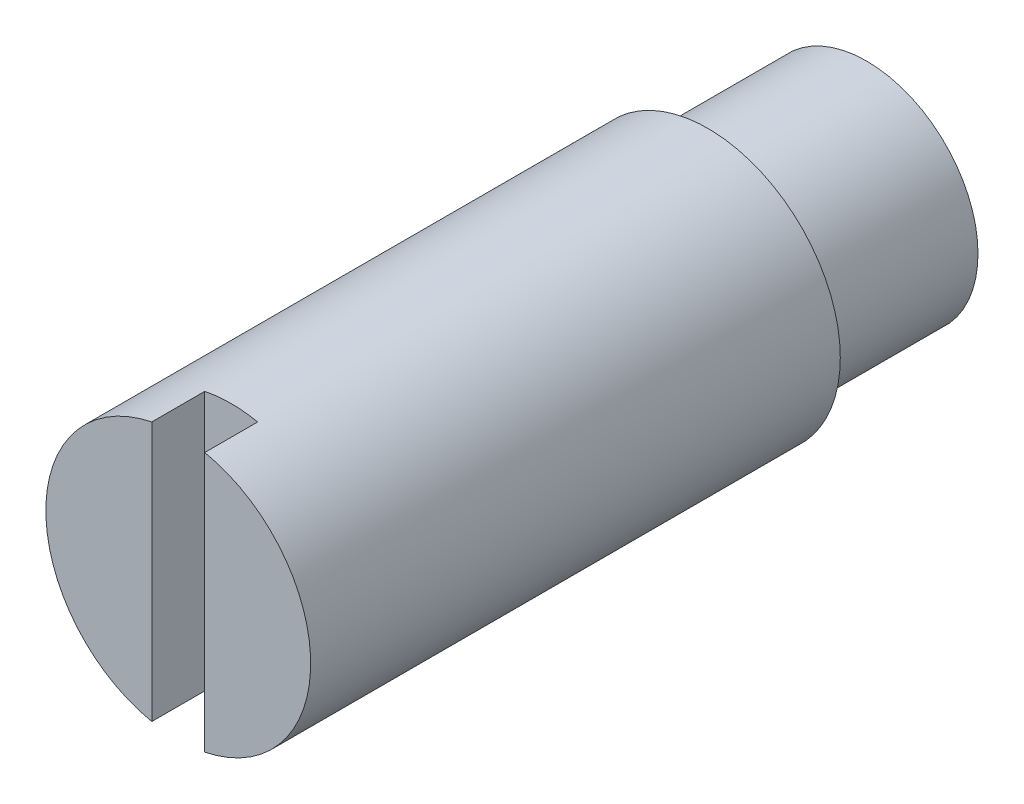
ISO-10303-21;
HEADER;
FILE_DESCRIPTION(('STEP AP214'),'2;1');
FILE_NAME('part.step','',(''),(''),'','','');
FILE_SCHEMA(('AUTOMOTIVE_DESIGN { 1 0 10303 214 1 1 1 1 }'));
ENDSEC;
DATA;
#1=APPLICATION_CONTEXT('core data for automotive mechanical design processes');
#2=APPLICATION_PROTOCOL_DEFINITION('international standard','automotive_design',2000,#1);
#3=PRODUCT_CONTEXT('',#1,'mechanical');
#4=PRODUCT('Part','Part','',(#3));
#5=PRODUCT_RELATED_PRODUCT_CATEGORY('part','',(#4));
#6=PRODUCT_DEFINITION_FORMATION('','',#4);
#7=PRODUCT_DEFINITION_CONTEXT('part definition',#1,'design');
#8=PRODUCT_DEFINITION('design','',#6,#7);
#9=PRODUCT_DEFINITION_SHAPE('','',#8);
#10=(LENGTH_UNIT() NAMED_UNIT(*) SI_UNIT(.MILLI.,.METRE.));
#11=(NAMED_UNIT(*) PLANE_ANGLE_UNIT() SI_UNIT($,.RADIAN.));
#12=(NAMED_UNIT(*) SI_UNIT($,.STERADIAN.) SOLID_ANGLE_UNIT());
#13=UNCERTAINTY_MEASURE_WITH_UNIT(LENGTH_MEASURE(1.E-05),#10,'distance_accuracy_value','');
#14=(GEOMETRIC_REPRESENTATION_CONTEXT(3) GLOBAL_UNCERTAINTY_ASSIGNED_CONTEXT((#13)) GLOBAL_UNIT_ASSIGNED_CONTEXT((#10,
#11,#12)) REPRESENTATION_CONTEXT('',''));
#15=CARTESIAN_POINT('',(0.,0.,0.));
#16=DIRECTION('',(0.,0.,1.));
#17=DIRECTION('',(1.,0.,0.));
#18=AXIS2_PLACEMENT_3D('',#15,#16,#17);
#19=CARTESIAN_POINT('',(0.,0.,13.));
#20=DIRECTION('',(0.,0.,1.));
#21=DIRECTION('',(1.,0.,0.));
#22=AXIS2_PLACEMENT_3D('',#19,#20,#21);
#23=PLANE('',#22);
#24=DIRECTION('',(0.,1.,0.));
#25=VECTOR('',#24,1.);
#26=CARTESIAN_POINT('',(0.5,0.,13.));
#27=LINE('',#26,#25);
#28=CARTESIAN_POINT('',(0.5,-2.44948974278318,13.));
#29=VERTEX_POINT('',#28);
#30=CARTESIAN_POINT('',(0.5,2.44948974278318,13.));
#31=VERTEX_POINT('',#30);
#32=EDGE_CURVE('E78',#29,#31,#27,.T.);
#33=ORIENTED_EDGE('',*,*,#32,.F.);
#34=CARTESIAN_POINT('',(0.,0.,13.));
#35=DIRECTION('',(0.,0.,1.));
#36=DIRECTION('',(1.,0.,0.));
#37=AXIS2_PLACEMENT_3D('',#34,#35,#36);
#38=CIRCLE('',#37,2.5);
#39=EDGE_CURVE('E86',#29,#31,#38,.T.);
#40=ORIENTED_EDGE('',*,*,#39,.T.);
#41=EDGE_LOOP('',(#33,#40));
#42=FACE_BOUND('',#41,.T.);
#43=ADVANCED_FACE('F32',(#42),#23,.T.);
#44=CARTESIAN_POINT('',(0.,0.,13.));
#45=DIRECTION('',(0.,0.,-1.));
#46=DIRECTION('',(-1.,0.,0.));
#47=AXIS2_PLACEMENT_3D('',#44,#45,#46);
#48=CYLINDRICAL_SURFACE('',#47,2.5);
#49=CARTESIAN_POINT('',(0.,0.,12.));
#50=DIRECTION('',(0.,0.,1.));
#51=DIRECTION('',(1.,0.,0.));
#52=AXIS2_PLACEMENT_3D('',#49,#50,#51);
#53=CIRCLE('',#52,2.5);
#54=CARTESIAN_POINT('',(0.5,2.44948974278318,12.));
#55=VERTEX_POINT('',#54);
#56=CARTESIAN_POINT('',(-0.5,2.44948974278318,12.));
#57=VERTEX_POINT('',#56);
#58=EDGE_CURVE('E11',#55,#57,#53,.T.);
#59=ORIENTED_EDGE('',*,*,#58,.F.);
#60=DIRECTION('',(0.,0.,-1.));
#61=VECTOR('',#60,1.);
#62=CARTESIAN_POINT('',(0.5,2.44948974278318,13.));
#63=LINE('',#62,#61);
#64=EDGE_CURVE('E105',#55,#31,#63,.F.);
#65=ORIENTED_EDGE('',*,*,#64,.T.);
#66=ORIENTED_EDGE('',*,*,#39,.F.);
#67=DIRECTION('',(0.,0.,-1.));
#68=VECTOR('',#67,1.);
#69=CARTESIAN_POINT('',(0.5,-2.44948974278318,13.));
#70=LINE('',#69,#68);
#71=CARTESIAN_POINT('',(0.5,-2.44948974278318,12.));
#72=VERTEX_POINT('',#71);
#73=EDGE_CURVE('E104',#29,#72,#70,.T.);
#74=ORIENTED_EDGE('',*,*,#73,.T.);
#75=CARTESIAN_POINT('',(-0.5,-2.44948974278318,12.));
#76=VERTEX_POINT('',#75);
#77=EDGE_CURVE('E36',#76,#72,#53,.T.);
#78=ORIENTED_EDGE('',*,*,#77,.F.);
#79=DIRECTION('',(0.,0.,-1.));
#80=VECTOR('',#79,1.);
#81=CARTESIAN_POINT('',(-0.5,-2.44948974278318,13.));
#82=LINE('',#81,#80);
#83=CARTESIAN_POINT('',(-0.5,-2.44948974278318,13.));
#84=VERTEX_POINT('',#83);
#85=EDGE_CURVE('E73',#76,#84,#82,.F.);
#86=ORIENTED_EDGE('',*,*,#85,.T.);
#87=CARTESIAN_POINT('',(-0.5,2.44948974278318,13.));
#88=VERTEX_POINT('',#87);
#89=EDGE_CURVE('E79',#88,#84,#38,.T.);
#90=ORIENTED_EDGE('',*,*,#89,.F.);
#91=DIRECTION('',(0.,0.,-1.));
#92=VECTOR('',#91,1.);
#93=CARTESIAN_POINT('',(-0.5,2.44948974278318,13.));
#94=LINE('',#93,#92);
#95=EDGE_CURVE('E47',#88,#57,#94,.T.);
#96=ORIENTED_EDGE('',*,*,#95,.T.);
#97=EDGE_LOOP('',(#59,#65,#66,#74,#78,#86,#90,#96));
#98=FACE_BOUND('',#97,.T.);
#99=CARTESIAN_POINT('',(0.,0.,3.));
#100=DIRECTION('',(0.,0.,1.));
#101=DIRECTION('',(1.,0.,0.));
#102=AXIS2_PLACEMENT_3D('',#99,#100,#101);
#103=CIRCLE('',#102,2.5);
#104=CARTESIAN_POINT('',(2.5,0.,3.));
#105=VERTEX_POINT('',#104);
#106=EDGE_CURVE('E89',#105,#105,#103,.T.);
#107=ORIENTED_EDGE('',*,*,#106,.T.);
#108=EDGE_LOOP('',(#107));
#109=FACE_BOUND('',#108,.T.);
#110=ADVANCED_FACE('F34',(#98,#109),#48,.T.);
#111=DIRECTION('',(0.,-1.,0.));
#112=VECTOR('',#111,1.);
#113=CARTESIAN_POINT('',(-0.5,0.,13.));
#114=LINE('',#113,#112);
#115=EDGE_CURVE('E70',#88,#84,#114,.T.);
#116=ORIENTED_EDGE('',*,*,#115,.F.);
#117=ORIENTED_EDGE('',*,*,#89,.T.);
#118=EDGE_LOOP('',(#116,#117));
#119=FACE_BOUND('',#118,.T.);
#120=ADVANCED_FACE('F85',(#119),#23,.T.);
#121=CARTESIAN_POINT('',(0.,0.,3.));
#122=DIRECTION('',(0.,0.,1.));
#123=DIRECTION('',(1.,0.,0.));
#124=AXIS2_PLACEMENT_3D('',#121,#122,#123);
#125=PLANE('',#124);
#126=CARTESIAN_POINT('',(0.,0.,3.));
#127=DIRECTION('',(0.,0.,1.));
#128=DIRECTION('',(1.,0.,0.));
#129=AXIS2_PLACEMENT_3D('',#126,#127,#128);
#130=CIRCLE('',#129,2.1);
#131=CARTESIAN_POINT('',(2.1,0.,3.));
#132=VERTEX_POINT('',#131);
#133=EDGE_CURVE('E95',#132,#132,#130,.T.);
#134=ORIENTED_EDGE('',*,*,#133,.T.);
#135=EDGE_LOOP('',(#134));
#136=FACE_BOUND('',#135,.T.);
#137=ORIENTED_EDGE('',*,*,#106,.F.);
#138=EDGE_LOOP('',(#137));
#139=FACE_BOUND('',#138,.T.);
#140=ADVANCED_FACE('F115',(#136,#139),#125,.F.);
#141=CARTESIAN_POINT('',(0.,0.,3.));
#142=DIRECTION('',(0.,0.,-1.));
#143=DIRECTION('',(-1.,0.,0.));
#144=AXIS2_PLACEMENT_3D('',#141,#142,#143);
#145=CYLINDRICAL_SURFACE('',#144,2.1);
#146=ORIENTED_EDGE('',*,*,#133,.F.);
#147=EDGE_LOOP('',(#146));
#148=FACE_BOUND('',#147,.T.);
#149=CARTESIAN_POINT('',(0.,0.,0.));
#150=DIRECTION('',(0.,0.,1.));
#151=DIRECTION('',(1.,0.,0.));
#152=AXIS2_PLACEMENT_3D('',#149,#150,#151);
#153=CIRCLE('',#152,2.1);
#154=CARTESIAN_POINT('',(2.1,0.,0.));
#155=VERTEX_POINT('',#154);
#156=EDGE_CURVE('E92',#155,#155,#153,.T.);
#157=ORIENTED_EDGE('',*,*,#156,.T.);
#158=EDGE_LOOP('',(#157));
#159=FACE_BOUND('',#158,.T.);
#160=ADVANCED_FACE('F118',(#148,#159),#145,.T.);
#161=CARTESIAN_POINT('',(0.,0.,0.));
#162=DIRECTION('',(0.,0.,1.));
#163=DIRECTION('',(1.,0.,0.));
#164=AXIS2_PLACEMENT_3D('',#161,#162,#163);
#165=PLANE('',#164);
#166=ORIENTED_EDGE('',*,*,#156,.F.);
#167=EDGE_LOOP('',(#166));
#168=FACE_BOUND('',#167,.T.);
#169=ADVANCED_FACE('F121',(#168),#165,.F.);
#170=CARTESIAN_POINT('',(-0.5,2.5,12.));
#171=DIRECTION('',(0.,0.,1.));
#172=DIRECTION('',(1.,0.,0.));
#173=AXIS2_PLACEMENT_3D('',#170,#171,#172);
#174=PLANE('',#173);
#175=DIRECTION('',(0.,1.,0.));
#176=VECTOR('',#175,1.);
#177=CARTESIAN_POINT('',(0.5,2.5,12.));
#178=LINE('',#177,#176);
#179=EDGE_CURVE('E83',#72,#55,#178,.T.);
#180=ORIENTED_EDGE('',*,*,#179,.T.);
#181=ORIENTED_EDGE('',*,*,#58,.T.);
#182=DIRECTION('',(0.,-1.,0.));
#183=VECTOR('',#182,1.);
#184=CARTESIAN_POINT('',(-0.5,2.5,12.));
#185=LINE('',#184,#183);
#186=EDGE_CURVE('E102',#57,#76,#185,.T.);
#187=ORIENTED_EDGE('',*,*,#186,.T.);
#188=ORIENTED_EDGE('',*,*,#77,.T.);
#189=EDGE_LOOP('',(#180,#181,#187,#188));
#190=FACE_BOUND('',#189,.T.);
#191=ADVANCED_FACE('F101',(#190),#174,.T.);
#192=CARTESIAN_POINT('',(0.5,2.5,12.));
#193=DIRECTION('',(1.,0.,0.));
#194=DIRECTION('',(0.,0.,-1.));
#195=AXIS2_PLACEMENT_3D('',#192,#193,#194);
#196=PLANE('',#195);
#197=ORIENTED_EDGE('',*,*,#32,.T.);
#198=ORIENTED_EDGE('',*,*,#64,.F.);
#199=ORIENTED_EDGE('',*,*,#179,.F.);
#200=ORIENTED_EDGE('',*,*,#73,.F.);
#201=EDGE_LOOP('',(#197,#198,#199,#200));
#202=FACE_BOUND('',#201,.T.);
#203=ADVANCED_FACE('F103',(#202),#196,.F.);
#204=CARTESIAN_POINT('',(-0.5,2.5,12.));
#205=DIRECTION('',(-1.,0.,0.));
#206=DIRECTION('',(0.,0.,1.));
#207=AXIS2_PLACEMENT_3D('',#204,#205,#206);
#208=PLANE('',#207);
#209=ORIENTED_EDGE('',*,*,#115,.T.);
#210=ORIENTED_EDGE('',*,*,#85,.F.);
#211=ORIENTED_EDGE('',*,*,#186,.F.);
#212=ORIENTED_EDGE('',*,*,#95,.F.);
#213=EDGE_LOOP('',(#209,#210,#211,#212));
#214=FACE_BOUND('',#213,.T.);
#215=ADVANCED_FACE('F72',(#214),#208,.F.);
#216=CLOSED_SHELL('',(#43,#110,#120,#140,#160,#169,#191,#203,#215));
#217=MANIFOLD_SOLID_BREP('B2',#216);
#218=ADVANCED_BREP_SHAPE_REPRESENTATION('',(#18,#217),#14);
#219=SHAPE_DEFINITION_REPRESENTATION(#9,#218);
ENDSEC;
END-ISO-10303-21;
